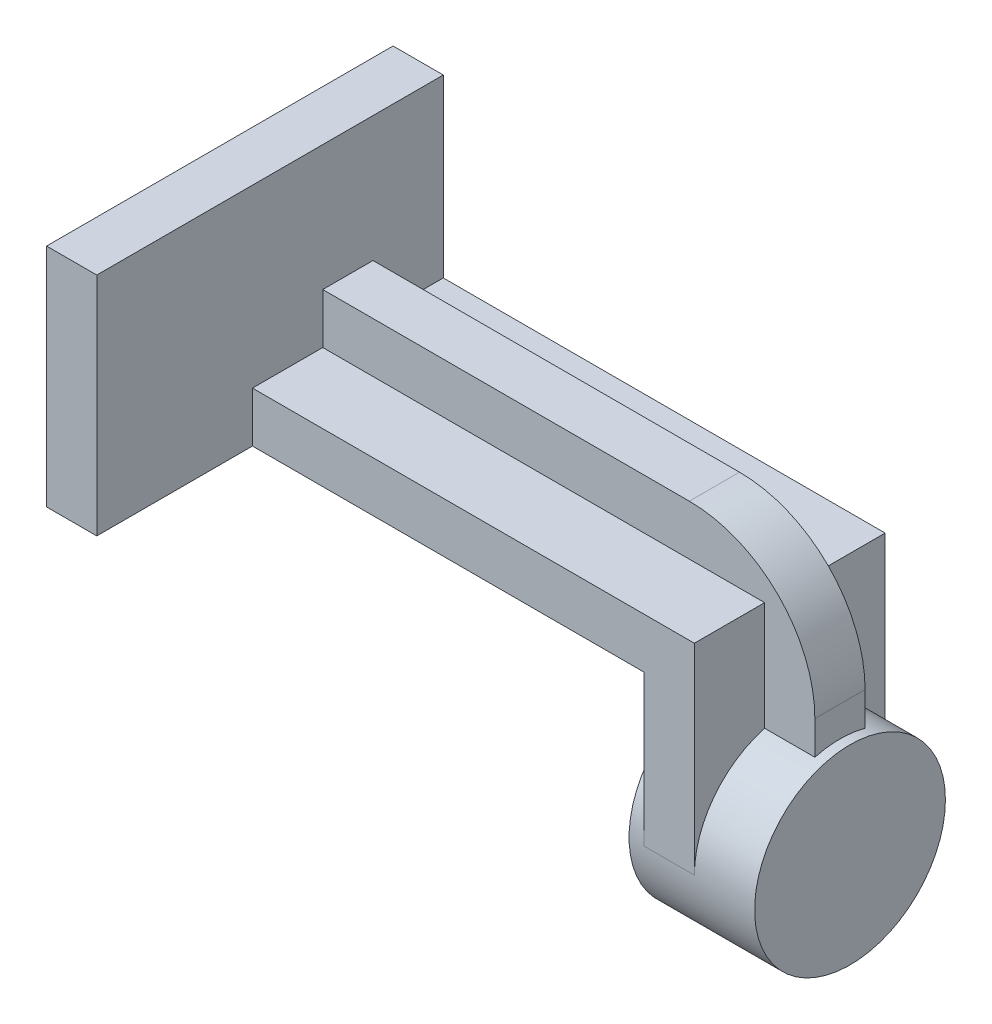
ISO-10303-21;
HEADER;
FILE_DESCRIPTION(('STEP AP214'),'2;1');
FILE_NAME('part.step','',(''),(''),'','','');
FILE_SCHEMA(('AUTOMOTIVE_DESIGN { 1 0 10303 214 1 1 1 1 }'));
ENDSEC;
DATA;
#1=APPLICATION_CONTEXT('core data for automotive mechanical design processes');
#2=APPLICATION_PROTOCOL_DEFINITION('international standard','automotive_design',2000,#1);
#3=PRODUCT_CONTEXT('',#1,'mechanical');
#4=PRODUCT('Part','Part','',(#3));
#5=PRODUCT_RELATED_PRODUCT_CATEGORY('part','',(#4));
#6=PRODUCT_DEFINITION_FORMATION('','',#4);
#7=PRODUCT_DEFINITION_CONTEXT('part definition',#1,'design');
#8=PRODUCT_DEFINITION('design','',#6,#7);
#9=PRODUCT_DEFINITION_SHAPE('','',#8);
#10=(LENGTH_UNIT() NAMED_UNIT(*) SI_UNIT(.MILLI.,.METRE.));
#11=(NAMED_UNIT(*) PLANE_ANGLE_UNIT() SI_UNIT($,.RADIAN.));
#12=(NAMED_UNIT(*) SI_UNIT($,.STERADIAN.) SOLID_ANGLE_UNIT());
#13=UNCERTAINTY_MEASURE_WITH_UNIT(LENGTH_MEASURE(1.E-05),#10,'distance_accuracy_value','');
#14=(GEOMETRIC_REPRESENTATION_CONTEXT(3) GLOBAL_UNCERTAINTY_ASSIGNED_CONTEXT((#13)) GLOBAL_UNIT_ASSIGNED_CONTEXT((#10,
#11,#12)) REPRESENTATION_CONTEXT('',''));
#15=CARTESIAN_POINT('',(0.,0.,0.));
#16=DIRECTION('',(0.,0.,1.));
#17=DIRECTION('',(1.,0.,0.));
#18=AXIS2_PLACEMENT_3D('',#15,#16,#17);
#19=CARTESIAN_POINT('',(98.,10.,3.5));
#20=DIRECTION('',(1.,0.,0.));
#21=DIRECTION('',(0.,0.,-1.));
#22=AXIS2_PLACEMENT_3D('',#19,#20,#21);
#23=PLANE('',#22);
#24=CARTESIAN_POINT('',(98.,-30.,-15.5));
#25=DIRECTION('',(1.,0.,0.));
#26=DIRECTION('',(0.,0.,-1.));
#27=AXIS2_PLACEMENT_3D('',#24,#25,#26);
#28=CIRCLE('',#27,19.);
#29=CARTESIAN_POINT('',(98.,-11.6696972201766,-10.5));
#30=VERTEX_POINT('',#29);
#31=CARTESIAN_POINT('',(98.,-30.,3.5));
#32=VERTEX_POINT('',#31);
#33=EDGE_CURVE('E205',#30,#32,#28,.T.);
#34=ORIENTED_EDGE('',*,*,#33,.F.);
#35=DIRECTION('',(0.,1.,0.));
#36=VECTOR('',#35,1.);
#37=CARTESIAN_POINT('',(98.,10.,-10.5));
#38=LINE('',#37,#36);
#39=CARTESIAN_POINT('',(98.,10.,-10.5));
#40=VERTEX_POINT('',#39);
#41=EDGE_CURVE('E50',#30,#40,#38,.T.);
#42=ORIENTED_EDGE('',*,*,#41,.T.);
#43=DIRECTION('',(0.,0.,-1.));
#44=VECTOR('',#43,1.);
#45=CARTESIAN_POINT('',(98.,10.,3.5));
#46=LINE('',#45,#44);
#47=CARTESIAN_POINT('',(98.,10.,3.5));
#48=VERTEX_POINT('',#47);
#49=EDGE_CURVE('E238',#48,#40,#46,.T.);
#50=ORIENTED_EDGE('',*,*,#49,.F.);
#51=DIRECTION('',(0.,-1.,0.));
#52=VECTOR('',#51,1.);
#53=CARTESIAN_POINT('',(98.,10.,3.5));
#54=LINE('',#53,#52);
#55=EDGE_CURVE('E215',#48,#32,#54,.T.);
#56=ORIENTED_EDGE('',*,*,#55,.T.);
#57=EDGE_LOOP('',(#34,#42,#50,#56));
#58=FACE_BOUND('',#57,.T.);
#59=ADVANCED_FACE('F33',(#58),#23,.T.);
#60=CARTESIAN_POINT('',(10.,10.,3.5));
#61=DIRECTION('',(0.,1.,0.));
#62=DIRECTION('',(-1.,0.,0.));
#63=AXIS2_PLACEMENT_3D('',#60,#61,#62);
#64=PLANE('',#63);
#65=ORIENTED_EDGE('',*,*,#49,.T.);
#66=DIRECTION('',(-1.,0.,0.));
#67=VECTOR('',#66,1.);
#68=CARTESIAN_POINT('',(10.,10.,-10.5));
#69=LINE('',#68,#67);
#70=CARTESIAN_POINT('',(10.,10.,-10.5));
#71=VERTEX_POINT('',#70);
#72=EDGE_CURVE('E183',#40,#71,#69,.T.);
#73=ORIENTED_EDGE('',*,*,#72,.T.);
#74=DIRECTION('',(0.,0.,-1.));
#75=VECTOR('',#74,1.);
#76=CARTESIAN_POINT('',(10.,10.,3.5));
#77=LINE('',#76,#75);
#78=CARTESIAN_POINT('',(10.,10.,3.5));
#79=VERTEX_POINT('',#78);
#80=EDGE_CURVE('E247',#79,#71,#77,.T.);
#81=ORIENTED_EDGE('',*,*,#80,.F.);
#82=DIRECTION('',(1.,0.,0.));
#83=VECTOR('',#82,1.);
#84=CARTESIAN_POINT('',(10.,10.,3.5));
#85=LINE('',#84,#83);
#86=EDGE_CURVE('E212',#79,#48,#85,.T.);
#87=ORIENTED_EDGE('',*,*,#86,.T.);
#88=EDGE_LOOP('',(#65,#73,#81,#87));
#89=FACE_BOUND('',#88,.T.);
#90=ADVANCED_FACE('F325',(#89),#64,.T.);
#91=CARTESIAN_POINT('',(10.,0.,-34.5));
#92=DIRECTION('',(0.,0.,1.));
#93=DIRECTION('',(1.,0.,0.));
#94=AXIS2_PLACEMENT_3D('',#91,#92,#93);
#95=PLANE('',#94);
#96=DIRECTION('',(0.,1.,0.));
#97=VECTOR('',#96,1.);
#98=CARTESIAN_POINT('',(0.,0.,-34.5));
#99=LINE('',#98,#97);
#100=CARTESIAN_POINT('',(0.,0.,-34.5));
#101=VERTEX_POINT('',#100);
#102=CARTESIAN_POINT('',(0.,45.,-34.5));
#103=VERTEX_POINT('',#102);
#104=EDGE_CURVE('E237',#101,#103,#99,.T.);
#105=ORIENTED_EDGE('',*,*,#104,.T.);
#106=DIRECTION('',(-1.,0.,0.));
#107=VECTOR('',#106,1.);
#108=CARTESIAN_POINT('',(10.,45.,-34.5));
#109=LINE('',#108,#107);
#110=CARTESIAN_POINT('',(10.,45.,-34.5));
#111=VERTEX_POINT('',#110);
#112=EDGE_CURVE('E43',#111,#103,#109,.T.);
#113=ORIENTED_EDGE('',*,*,#112,.F.);
#114=DIRECTION('',(0.,1.,0.));
#115=VECTOR('',#114,1.);
#116=CARTESIAN_POINT('',(10.,0.,-34.5));
#117=LINE('',#116,#115);
#118=CARTESIAN_POINT('',(10.,10.,-34.5));
#119=VERTEX_POINT('',#118);
#120=EDGE_CURVE('E282',#119,#111,#117,.T.);
#121=ORIENTED_EDGE('',*,*,#120,.F.);
#122=DIRECTION('',(1.,0.,0.));
#123=VECTOR('',#122,1.);
#124=CARTESIAN_POINT('',(10.,10.,-34.5));
#125=LINE('',#124,#123);
#126=CARTESIAN_POINT('',(98.,10.,-34.5));
#127=VERTEX_POINT('',#126);
#128=EDGE_CURVE('E211',#119,#127,#125,.T.);
#129=ORIENTED_EDGE('',*,*,#128,.T.);
#130=DIRECTION('',(0.,-1.,0.));
#131=VECTOR('',#130,1.);
#132=CARTESIAN_POINT('',(98.,10.,-34.5));
#133=LINE('',#132,#131);
#134=CARTESIAN_POINT('',(98.,-30.,-34.5));
#135=VERTEX_POINT('',#134);
#136=EDGE_CURVE('E226',#127,#135,#133,.T.);
#137=ORIENTED_EDGE('',*,*,#136,.T.);
#138=DIRECTION('',(-1.,0.,0.));
#139=VECTOR('',#138,1.);
#140=CARTESIAN_POINT('',(98.,-30.,-34.5));
#141=LINE('',#140,#139);
#142=CARTESIAN_POINT('',(88.,-30.,-34.5));
#143=VERTEX_POINT('',#142);
#144=EDGE_CURVE('E229',#135,#143,#141,.T.);
#145=ORIENTED_EDGE('',*,*,#144,.T.);
#146=DIRECTION('',(0.,1.,0.));
#147=VECTOR('',#146,1.);
#148=CARTESIAN_POINT('',(88.,-30.,-34.5));
#149=LINE('',#148,#147);
#150=CARTESIAN_POINT('',(88.,0.,-34.5));
#151=VERTEX_POINT('',#150);
#152=EDGE_CURVE('E232',#143,#151,#149,.T.);
#153=ORIENTED_EDGE('',*,*,#152,.T.);
#154=DIRECTION('',(-1.,0.,0.));
#155=VECTOR('',#154,1.);
#156=CARTESIAN_POINT('',(10.,0.,-34.5));
#157=LINE('',#156,#155);
#158=EDGE_CURVE('E273',#151,#101,#157,.T.);
#159=ORIENTED_EDGE('',*,*,#158,.T.);
#160=EDGE_LOOP('',(#105,#113,#121,#129,#137,#145,#153,#159));
#161=FACE_BOUND('',#160,.T.);
#162=ADVANCED_FACE('F35',(#161),#95,.F.);
#163=CARTESIAN_POINT('',(10.,45.,34.5));
#164=DIRECTION('',(0.,-1.,0.));
#165=DIRECTION('',(0.,0.,-1.));
#166=AXIS2_PLACEMENT_3D('',#163,#164,#165);
#167=PLANE('',#166);
#168=DIRECTION('',(0.,0.,1.));
#169=VECTOR('',#168,1.);
#170=CARTESIAN_POINT('',(0.,45.,34.5));
#171=LINE('',#170,#169);
#172=CARTESIAN_POINT('',(0.,45.,34.5));
#173=VERTEX_POINT('',#172);
#174=EDGE_CURVE('E288',#103,#173,#171,.T.);
#175=ORIENTED_EDGE('',*,*,#174,.T.);
#176=DIRECTION('',(-1.,0.,0.));
#177=VECTOR('',#176,1.);
#178=CARTESIAN_POINT('',(10.,45.,34.5));
#179=LINE('',#178,#177);
#180=CARTESIAN_POINT('',(10.,45.,34.5));
#181=VERTEX_POINT('',#180);
#182=EDGE_CURVE('E295',#181,#173,#179,.T.);
#183=ORIENTED_EDGE('',*,*,#182,.F.);
#184=DIRECTION('',(0.,0.,1.));
#185=VECTOR('',#184,1.);
#186=CARTESIAN_POINT('',(10.,45.,34.5));
#187=LINE('',#186,#185);
#188=EDGE_CURVE('E278',#111,#181,#187,.T.);
#189=ORIENTED_EDGE('',*,*,#188,.F.);
#190=ORIENTED_EDGE('',*,*,#112,.T.);
#191=EDGE_LOOP('',(#175,#183,#189,#190));
#192=FACE_BOUND('',#191,.T.);
#193=ADVANCED_FACE('F301',(#192),#167,.F.);
#194=CARTESIAN_POINT('',(10.,0.,34.5));
#195=DIRECTION('',(0.,0.,-1.));
#196=DIRECTION('',(0.,1.,0.));
#197=AXIS2_PLACEMENT_3D('',#194,#195,#196);
#198=PLANE('',#197);
#199=DIRECTION('',(0.,-1.,0.));
#200=VECTOR('',#199,1.);
#201=CARTESIAN_POINT('',(0.,0.,34.5));
#202=LINE('',#201,#200);
#203=CARTESIAN_POINT('',(0.,0.,34.5));
#204=VERTEX_POINT('',#203);
#205=EDGE_CURVE('E290',#173,#204,#202,.T.);
#206=ORIENTED_EDGE('',*,*,#205,.T.);
#207=DIRECTION('',(-1.,0.,0.));
#208=VECTOR('',#207,1.);
#209=CARTESIAN_POINT('',(10.,0.,34.5));
#210=LINE('',#209,#208);
#211=CARTESIAN_POINT('',(10.,0.,34.5));
#212=VERTEX_POINT('',#211);
#213=EDGE_CURVE('E276',#212,#204,#210,.T.);
#214=ORIENTED_EDGE('',*,*,#213,.F.);
#215=DIRECTION('',(0.,-1.,0.));
#216=VECTOR('',#215,1.);
#217=CARTESIAN_POINT('',(10.,0.,34.5));
#218=LINE('',#217,#216);
#219=EDGE_CURVE('E271',#181,#212,#218,.T.);
#220=ORIENTED_EDGE('',*,*,#219,.F.);
#221=ORIENTED_EDGE('',*,*,#182,.T.);
#222=EDGE_LOOP('',(#206,#214,#220,#221));
#223=FACE_BOUND('',#222,.T.);
#224=ADVANCED_FACE('F311',(#223),#198,.F.);
#225=CARTESIAN_POINT('',(10.,0.,34.5));
#226=DIRECTION('',(0.,1.,0.));
#227=DIRECTION('',(0.,0.,1.));
#228=AXIS2_PLACEMENT_3D('',#225,#226,#227);
#229=PLANE('',#228);
#230=ORIENTED_EDGE('',*,*,#158,.F.);
#231=DIRECTION('',(0.,0.,-1.));
#232=VECTOR('',#231,1.);
#233=CARTESIAN_POINT('',(88.,0.,3.5));
#234=LINE('',#233,#232);
#235=CARTESIAN_POINT('',(88.,0.,3.5));
#236=VERTEX_POINT('',#235);
#237=EDGE_CURVE('E235',#236,#151,#234,.T.);
#238=ORIENTED_EDGE('',*,*,#237,.F.);
#239=DIRECTION('',(-1.,0.,0.));
#240=VECTOR('',#239,1.);
#241=CARTESIAN_POINT('',(88.,0.,3.5));
#242=LINE('',#241,#240);
#243=CARTESIAN_POINT('',(10.,0.,3.5));
#244=VERTEX_POINT('',#243);
#245=EDGE_CURVE('E225',#236,#244,#242,.T.);
#246=ORIENTED_EDGE('',*,*,#245,.T.);
#247=DIRECTION('',(0.,0.,-1.));
#248=VECTOR('',#247,1.);
#249=CARTESIAN_POINT('',(10.,0.,34.5));
#250=LINE('',#249,#248);
#251=EDGE_CURVE('E267',#212,#244,#250,.T.);
#252=ORIENTED_EDGE('',*,*,#251,.F.);
#253=ORIENTED_EDGE('',*,*,#213,.T.);
#254=DIRECTION('',(0.,0.,-1.));
#255=VECTOR('',#254,1.);
#256=CARTESIAN_POINT('',(0.,0.,34.5));
#257=LINE('',#256,#255);
#258=EDGE_CURVE('E292',#204,#101,#257,.T.);
#259=ORIENTED_EDGE('',*,*,#258,.T.);
#260=EDGE_LOOP('',(#230,#238,#246,#252,#253,#259));
#261=FACE_BOUND('',#260,.T.);
#262=ADVANCED_FACE('F265',(#261),#229,.F.);
#263=CARTESIAN_POINT('',(10.,45.,-34.5));
#264=DIRECTION('',(-1.,0.,0.));
#265=DIRECTION('',(0.,0.,1.));
#266=AXIS2_PLACEMENT_3D('',#263,#264,#265);
#267=PLANE('',#266);
#268=DIRECTION('',(0.,0.,-1.));
#269=VECTOR('',#268,1.);
#270=CARTESIAN_POINT('',(10.,20.,-34.5));
#271=LINE('',#270,#269);
#272=CARTESIAN_POINT('',(10.,20.,-10.5));
#273=VERTEX_POINT('',#272);
#274=CARTESIAN_POINT('',(10.,20.,-20.5));
#275=VERTEX_POINT('',#274);
#276=EDGE_CURVE('E196',#273,#275,#271,.T.);
#277=ORIENTED_EDGE('',*,*,#276,.T.);
#278=DIRECTION('',(0.,-1.,0.));
#279=VECTOR('',#278,1.);
#280=CARTESIAN_POINT('',(10.,45.,-20.5));
#281=LINE('',#280,#279);
#282=CARTESIAN_POINT('',(10.,10.,-20.5));
#283=VERTEX_POINT('',#282);
#284=EDGE_CURVE('E194',#275,#283,#281,.T.);
#285=ORIENTED_EDGE('',*,*,#284,.T.);
#286=EDGE_CURVE('E37',#283,#119,#77,.T.);
#287=ORIENTED_EDGE('',*,*,#286,.T.);
#288=ORIENTED_EDGE('',*,*,#120,.T.);
#289=ORIENTED_EDGE('',*,*,#188,.T.);
#290=ORIENTED_EDGE('',*,*,#219,.T.);
#291=ORIENTED_EDGE('',*,*,#251,.T.);
#292=DIRECTION('',(0.,1.,0.));
#293=VECTOR('',#292,1.);
#294=CARTESIAN_POINT('',(10.,0.,3.5));
#295=LINE('',#294,#293);
#296=EDGE_CURVE('E216',#244,#79,#295,.T.);
#297=ORIENTED_EDGE('',*,*,#296,.T.);
#298=ORIENTED_EDGE('',*,*,#80,.T.);
#299=DIRECTION('',(0.,-1.,0.));
#300=VECTOR('',#299,1.);
#301=CARTESIAN_POINT('',(10.,45.,-10.5));
#302=LINE('',#301,#300);
#303=EDGE_CURVE('E186',#273,#71,#302,.T.);
#304=ORIENTED_EDGE('',*,*,#303,.F.);
#305=EDGE_LOOP('',(#277,#285,#287,#288,#289,#290,#291,#297,#298,#304));
#306=FACE_BOUND('',#305,.T.);
#307=ADVANCED_FACE('F269',(#306),#267,.F.);
#308=CARTESIAN_POINT('',(0.,45.,-34.5));
#309=DIRECTION('',(-1.,0.,0.));
#310=DIRECTION('',(0.,0.,1.));
#311=AXIS2_PLACEMENT_3D('',#308,#309,#310);
#312=PLANE('',#311);
#313=ORIENTED_EDGE('',*,*,#104,.F.);
#314=ORIENTED_EDGE('',*,*,#258,.F.);
#315=ORIENTED_EDGE('',*,*,#205,.F.);
#316=ORIENTED_EDGE('',*,*,#174,.F.);
#317=EDGE_LOOP('',(#313,#314,#315,#316));
#318=FACE_BOUND('',#317,.T.);
#319=ADVANCED_FACE('F308',(#318),#312,.T.);
#320=CARTESIAN_POINT('',(88.,-30.,3.5));
#321=DIRECTION('',(-1.,0.,0.));
#322=DIRECTION('',(0.,0.,1.));
#323=AXIS2_PLACEMENT_3D('',#320,#321,#322);
#324=PLANE('',#323);
#325=ORIENTED_EDGE('',*,*,#152,.F.);
#326=CARTESIAN_POINT('',(88.,-30.,-15.5));
#327=DIRECTION('',(-1.,0.,0.));
#328=DIRECTION('',(0.,0.,1.));
#329=AXIS2_PLACEMENT_3D('',#326,#327,#328);
#330=CIRCLE('',#329,19.);
#331=CARTESIAN_POINT('',(88.,-30.,3.5));
#332=VERTEX_POINT('',#331);
#333=EDGE_CURVE('E209',#332,#143,#330,.T.);
#334=ORIENTED_EDGE('',*,*,#333,.F.);
#335=DIRECTION('',(0.,1.,0.));
#336=VECTOR('',#335,1.);
#337=CARTESIAN_POINT('',(88.,-30.,3.5));
#338=LINE('',#337,#336);
#339=EDGE_CURVE('E222',#332,#236,#338,.T.);
#340=ORIENTED_EDGE('',*,*,#339,.T.);
#341=ORIENTED_EDGE('',*,*,#237,.T.);
#342=EDGE_LOOP('',(#325,#334,#340,#341));
#343=FACE_BOUND('',#342,.T.);
#344=ADVANCED_FACE('F316',(#343),#324,.T.);
#345=DIRECTION('',(0.,1.,0.));
#346=VECTOR('',#345,1.);
#347=CARTESIAN_POINT('',(98.,10.,-20.5));
#348=LINE('',#347,#346);
#349=CARTESIAN_POINT('',(98.,-11.6696972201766,-20.5));
#350=VERTEX_POINT('',#349);
#351=CARTESIAN_POINT('',(98.,10.,-20.5));
#352=VERTEX_POINT('',#351);
#353=EDGE_CURVE('E190',#350,#352,#348,.T.);
#354=ORIENTED_EDGE('',*,*,#353,.F.);
#355=EDGE_CURVE('E206',#135,#350,#28,.T.);
#356=ORIENTED_EDGE('',*,*,#355,.F.);
#357=ORIENTED_EDGE('',*,*,#136,.F.);
#358=EDGE_CURVE('E240',#352,#127,#46,.T.);
#359=ORIENTED_EDGE('',*,*,#358,.F.);
#360=EDGE_LOOP('',(#354,#356,#357,#359));
#361=FACE_BOUND('',#360,.T.);
#362=ADVANCED_FACE('F345',(#361),#23,.T.);
#363=DIRECTION('',(-1.,0.,0.));
#364=VECTOR('',#363,1.);
#365=CARTESIAN_POINT('',(10.,10.,-20.5));
#366=LINE('',#365,#364);
#367=EDGE_CURVE('E192',#352,#283,#366,.T.);
#368=ORIENTED_EDGE('',*,*,#367,.F.);
#369=ORIENTED_EDGE('',*,*,#358,.T.);
#370=ORIENTED_EDGE('',*,*,#128,.F.);
#371=ORIENTED_EDGE('',*,*,#286,.F.);
#372=EDGE_LOOP('',(#368,#369,#370,#371));
#373=FACE_BOUND('',#372,.T.);
#374=ADVANCED_FACE('F350',(#373),#64,.T.);
#375=CARTESIAN_POINT('',(10.,10.,3.5));
#376=DIRECTION('',(0.,0.,-1.));
#377=DIRECTION('',(-1.,0.,0.));
#378=AXIS2_PLACEMENT_3D('',#375,#376,#377);
#379=PLANE('',#378);
#380=ORIENTED_EDGE('',*,*,#296,.F.);
#381=ORIENTED_EDGE('',*,*,#245,.F.);
#382=ORIENTED_EDGE('',*,*,#339,.F.);
#383=DIRECTION('',(-1.,0.,0.));
#384=VECTOR('',#383,1.);
#385=CARTESIAN_POINT('',(98.,-30.,3.5));
#386=LINE('',#385,#384);
#387=EDGE_CURVE('E219',#32,#332,#386,.T.);
#388=ORIENTED_EDGE('',*,*,#387,.F.);
#389=ORIENTED_EDGE('',*,*,#55,.F.);
#390=ORIENTED_EDGE('',*,*,#86,.F.);
#391=EDGE_LOOP('',(#380,#381,#382,#388,#389,#390));
#392=FACE_BOUND('',#391,.T.);
#393=ADVANCED_FACE('F318',(#392),#379,.F.);
#394=CARTESIAN_POINT('',(85.,-30.,-15.5));
#395=DIRECTION('',(1.,0.,0.));
#396=DIRECTION('',(0.,0.,-1.));
#397=AXIS2_PLACEMENT_3D('',#394,#395,#396);
#398=CYLINDRICAL_SURFACE('',#397,19.);
#399=CARTESIAN_POINT('',(85.,-30.,-15.5));
#400=DIRECTION('',(1.,0.,0.));
#401=DIRECTION('',(0.,0.,-1.));
#402=AXIS2_PLACEMENT_3D('',#399,#400,#401);
#403=CIRCLE('',#402,19.);
#404=CARTESIAN_POINT('',(85.,-30.,-34.5));
#405=VERTEX_POINT('',#404);
#406=EDGE_CURVE('E202',#405,#405,#403,.T.);
#407=ORIENTED_EDGE('',*,*,#406,.T.);
#408=EDGE_LOOP('',(#407));
#409=FACE_BOUND('',#408,.T.);
#410=ORIENTED_EDGE('',*,*,#333,.T.);
#411=ORIENTED_EDGE('',*,*,#144,.F.);
#412=ORIENTED_EDGE('',*,*,#355,.T.);
#413=DIRECTION('',(1.,0.,0.));
#414=VECTOR('',#413,1.);
#415=CARTESIAN_POINT('',(85.,-11.6696972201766,-20.5));
#416=LINE('',#415,#414);
#417=CARTESIAN_POINT('',(108.,-11.6696972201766,-20.5));
#418=VERTEX_POINT('',#417);
#419=EDGE_CURVE('E188',#418,#350,#416,.F.);
#420=ORIENTED_EDGE('',*,*,#419,.F.);
#421=CARTESIAN_POINT('',(108.,-30.,-15.5));
#422=DIRECTION('',(1.,0.,0.));
#423=DIRECTION('',(0.,0.,-1.));
#424=AXIS2_PLACEMENT_3D('',#421,#422,#423);
#425=CIRCLE('',#424,19.);
#426=CARTESIAN_POINT('',(108.,-11.6696972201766,-10.5));
#427=VERTEX_POINT('',#426);
#428=EDGE_CURVE('E11',#427,#418,#425,.F.);
#429=ORIENTED_EDGE('',*,*,#428,.F.);
#430=DIRECTION('',(1.,0.,0.));
#431=VECTOR('',#430,1.);
#432=CARTESIAN_POINT('',(85.,-11.6696972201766,-10.5));
#433=LINE('',#432,#431);
#434=EDGE_CURVE('E180',#427,#30,#433,.F.);
#435=ORIENTED_EDGE('',*,*,#434,.T.);
#436=ORIENTED_EDGE('',*,*,#33,.T.);
#437=ORIENTED_EDGE('',*,*,#387,.T.);
#438=EDGE_LOOP('',(#410,#411,#412,#420,#429,#435,#436,#437));
#439=FACE_BOUND('',#438,.T.);
#440=CARTESIAN_POINT('',(110.,-30.,-15.5));
#441=DIRECTION('',(1.,0.,0.));
#442=DIRECTION('',(0.,0.,-1.));
#443=AXIS2_PLACEMENT_3D('',#440,#441,#442);
#444=CIRCLE('',#443,19.);
#445=CARTESIAN_POINT('',(110.,-30.,-34.5));
#446=VERTEX_POINT('',#445);
#447=EDGE_CURVE('E199',#446,#446,#444,.T.);
#448=ORIENTED_EDGE('',*,*,#447,.F.);
#449=EDGE_LOOP('',(#448));
#450=FACE_BOUND('',#449,.T.);
#451=ADVANCED_FACE('F363',(#409,#439,#450),#398,.T.);
#452=CARTESIAN_POINT('',(85.,-30.,-15.5));
#453=DIRECTION('',(1.,0.,0.));
#454=DIRECTION('',(0.,0.,-1.));
#455=AXIS2_PLACEMENT_3D('',#452,#453,#454);
#456=PLANE('',#455);
#457=ORIENTED_EDGE('',*,*,#406,.F.);
#458=EDGE_LOOP('',(#457));
#459=FACE_BOUND('',#458,.T.);
#460=ADVANCED_FACE('F339',(#459),#456,.F.);
#461=CARTESIAN_POINT('',(110.,-30.,-15.5));
#462=DIRECTION('',(1.,0.,0.));
#463=DIRECTION('',(0.,0.,-1.));
#464=AXIS2_PLACEMENT_3D('',#461,#462,#463);
#465=PLANE('',#464);
#466=ORIENTED_EDGE('',*,*,#447,.T.);
#467=EDGE_LOOP('',(#466));
#468=FACE_BOUND('',#467,.T.);
#469=ADVANCED_FACE('F332',(#468),#465,.T.);
#470=CARTESIAN_POINT('',(10.,20.,-15.5));
#471=DIRECTION('',(0.,1.,0.));
#472=DIRECTION('',(1.,0.,0.));
#473=AXIS2_PLACEMENT_3D('',#470,#471,#472);
#474=PLANE('',#473);
#475=ORIENTED_EDGE('',*,*,#276,.F.);
#476=DIRECTION('',(-1.,0.,0.));
#477=VECTOR('',#476,1.);
#478=CARTESIAN_POINT('',(55.,20.,-10.5));
#479=LINE('',#478,#477);
#480=CARTESIAN_POINT('',(83.,20.,-10.5));
#481=VERTEX_POINT('',#480);
#482=EDGE_CURVE('E171',#273,#481,#479,.F.);
#483=ORIENTED_EDGE('',*,*,#482,.T.);
#484=DIRECTION('',(0.,0.,-1.));
#485=VECTOR('',#484,1.);
#486=CARTESIAN_POINT('',(83.,20.,-15.5));
#487=LINE('',#486,#485);
#488=CARTESIAN_POINT('',(83.,20.,-20.5));
#489=VERTEX_POINT('',#488);
#490=EDGE_CURVE('E158',#481,#489,#487,.T.);
#491=ORIENTED_EDGE('',*,*,#490,.T.);
#492=DIRECTION('',(-1.,0.,0.));
#493=VECTOR('',#492,1.);
#494=CARTESIAN_POINT('',(55.,20.,-20.5));
#495=LINE('',#494,#493);
#496=EDGE_CURVE('E159',#275,#489,#495,.F.);
#497=ORIENTED_EDGE('',*,*,#496,.F.);
#498=EDGE_LOOP('',(#475,#483,#491,#497));
#499=FACE_BOUND('',#498,.T.);
#500=ADVANCED_FACE('F330',(#499),#474,.T.);
#501=CARTESIAN_POINT('',(55.,-1.99998749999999,-20.5));
#502=DIRECTION('',(0.,0.,-1.));
#503=DIRECTION('',(-1.,0.,0.));
#504=AXIS2_PLACEMENT_3D('',#501,#502,#503);
#505=PLANE('',#504);
#506=ORIENTED_EDGE('',*,*,#284,.F.);
#507=ORIENTED_EDGE('',*,*,#496,.T.);
#508=CARTESIAN_POINT('',(83.,-5.00000000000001,-20.5));
#509=DIRECTION('',(0.,0.,-1.));
#510=DIRECTION('',(-1.,0.,0.));
#511=AXIS2_PLACEMENT_3D('',#508,#509,#510);
#512=CIRCLE('',#511,25.);
#513=CARTESIAN_POINT('',(108.,-5.,-20.5));
#514=VERTEX_POINT('',#513);
#515=EDGE_CURVE('E151',#489,#514,#512,.T.);
#516=ORIENTED_EDGE('',*,*,#515,.T.);
#517=DIRECTION('',(0.,1.,0.));
#518=VECTOR('',#517,1.);
#519=CARTESIAN_POINT('',(108.,-1.99998749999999,-20.5));
#520=LINE('',#519,#518);
#521=EDGE_CURVE('E164',#514,#418,#520,.F.);
#522=ORIENTED_EDGE('',*,*,#521,.T.);
#523=ORIENTED_EDGE('',*,*,#419,.T.);
#524=ORIENTED_EDGE('',*,*,#353,.T.);
#525=ORIENTED_EDGE('',*,*,#367,.T.);
#526=EDGE_LOOP('',(#506,#507,#516,#522,#523,#524,#525));
#527=FACE_BOUND('',#526,.T.);
#528=ADVANCED_FACE('F163',(#527),#505,.T.);
#529=CARTESIAN_POINT('',(55.,-1.99998749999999,-10.5));
#530=DIRECTION('',(0.,0.,-1.));
#531=DIRECTION('',(-1.,0.,0.));
#532=AXIS2_PLACEMENT_3D('',#529,#530,#531);
#533=PLANE('',#532);
#534=ORIENTED_EDGE('',*,*,#482,.F.);
#535=ORIENTED_EDGE('',*,*,#303,.T.);
#536=ORIENTED_EDGE('',*,*,#72,.F.);
#537=ORIENTED_EDGE('',*,*,#41,.F.);
#538=ORIENTED_EDGE('',*,*,#434,.F.);
#539=DIRECTION('',(0.,1.,0.));
#540=VECTOR('',#539,1.);
#541=CARTESIAN_POINT('',(108.,-1.99998749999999,-10.5));
#542=LINE('',#541,#540);
#543=CARTESIAN_POINT('',(108.,-5.,-10.5));
#544=VERTEX_POINT('',#543);
#545=EDGE_CURVE('E176',#544,#427,#542,.F.);
#546=ORIENTED_EDGE('',*,*,#545,.F.);
#547=CARTESIAN_POINT('',(83.,-5.00000000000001,-10.5));
#548=DIRECTION('',(0.,0.,-1.));
#549=DIRECTION('',(-1.,0.,0.));
#550=AXIS2_PLACEMENT_3D('',#547,#548,#549);
#551=CIRCLE('',#550,25.);
#552=EDGE_CURVE('E153',#481,#544,#551,.T.);
#553=ORIENTED_EDGE('',*,*,#552,.F.);
#554=EDGE_LOOP('',(#534,#535,#536,#537,#538,#546,#553));
#555=FACE_BOUND('',#554,.T.);
#556=ADVANCED_FACE('F328',(#555),#533,.F.);
#557=CARTESIAN_POINT('',(83.,-5.00000000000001,-15.5));
#558=DIRECTION('',(0.,0.,-1.));
#559=DIRECTION('',(-1.,0.,0.));
#560=AXIS2_PLACEMENT_3D('',#557,#558,#559);
#561=CYLINDRICAL_SURFACE('',#560,25.);
#562=ORIENTED_EDGE('',*,*,#490,.F.);
#563=ORIENTED_EDGE('',*,*,#552,.T.);
#564=DIRECTION('',(0.,0.,-1.));
#565=VECTOR('',#564,1.);
#566=CARTESIAN_POINT('',(108.,-5.,-15.5));
#567=LINE('',#566,#565);
#568=EDGE_CURVE('E147',#544,#514,#567,.T.);
#569=ORIENTED_EDGE('',*,*,#568,.T.);
#570=ORIENTED_EDGE('',*,*,#515,.F.);
#571=EDGE_LOOP('',(#562,#563,#569,#570));
#572=FACE_BOUND('',#571,.T.);
#573=ADVANCED_FACE('F150',(#572),#561,.T.);
#574=CARTESIAN_POINT('',(108.,-5.00000000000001,-15.5));
#575=DIRECTION('',(1.,0.,0.));
#576=DIRECTION('',(0.,-1.,0.));
#577=AXIS2_PLACEMENT_3D('',#574,#575,#576);
#578=PLANE('',#577);
#579=ORIENTED_EDGE('',*,*,#545,.T.);
#580=ORIENTED_EDGE('',*,*,#428,.T.);
#581=ORIENTED_EDGE('',*,*,#521,.F.);
#582=ORIENTED_EDGE('',*,*,#568,.F.);
#583=EDGE_LOOP('',(#579,#580,#581,#582));
#584=FACE_BOUND('',#583,.T.);
#585=ADVANCED_FACE('F169',(#584),#578,.T.);
#586=CLOSED_SHELL('',(#59,#90,#162,#193,#224,#262,#307,#319,#344,#362,#374,#393,#451,#460,#469,
#500,#528,#556,#573,#585));
#587=MANIFOLD_SOLID_BREP('B2',#586);
#588=ADVANCED_BREP_SHAPE_REPRESENTATION('',(#18,#587),#14);
#589=SHAPE_DEFINITION_REPRESENTATION(#9,#588);
ENDSEC;
END-ISO-10303-21;
